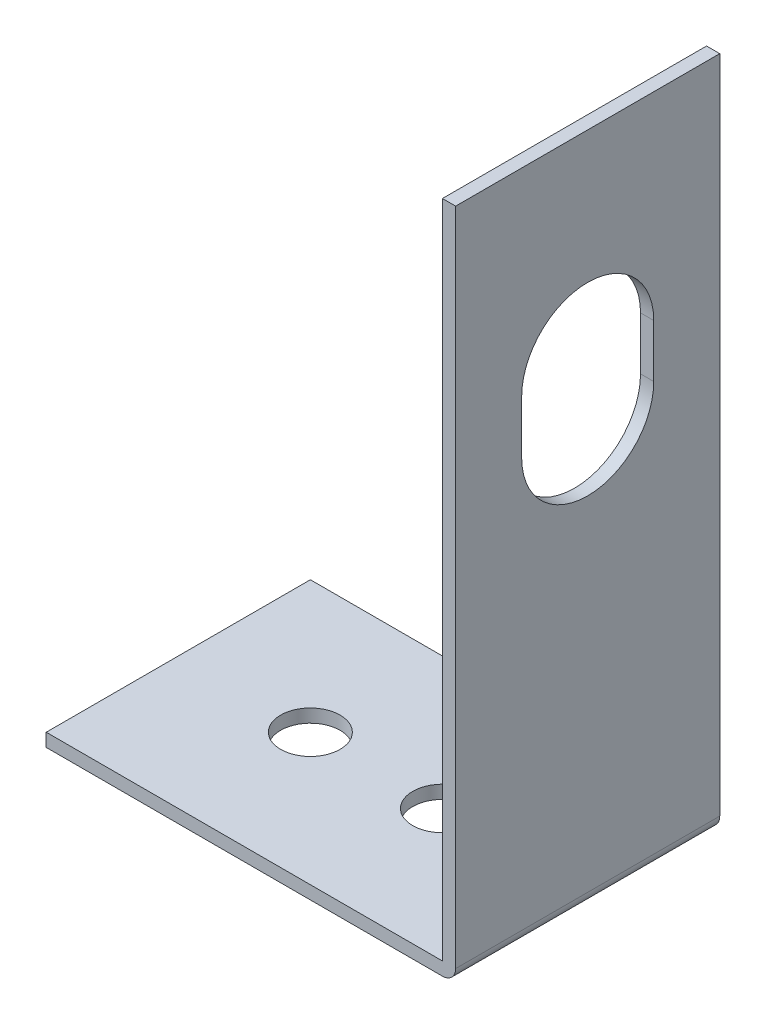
from build123d import *

# Parameters (mm, degrees)
EXTRUSION1_DEPTH        = 20
ENL_V_MAT_EXTRU_1_DEPTH = 62.64414003
ESQUISSE3_R             = 2.25
ENL_V_MAT_EXTRU_2_DEPTH = 62.64414003


with BuildPart() as part:
    # Esquisse1 → Extrusion1 (new body)
    with BuildSketch(Plane.XY):
        with BuildLine():
            Line((0, 0), (0, 50))
            Line((0, 50), (1, 50))
            Line((1, 50), (1, 0))
            ThreePointArc((1, 0), (0.707106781, -0.707106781), (0, -1))
            Line((0, -1), (-30, -1))
            Line((-30, -1), (-30, 0))
            Line((-30, 0), (0, 0))
        make_face()
    extrude(amount=EXTRUSION1_DEPTH)

    # Esquisse2 → Enl_v. mat.-Extru.1 (cut, through all)
    with BuildSketch(Plane.ZY):
        with BuildLine():
            Line((5, 35), (5, 31))
            ThreePointArc((5, 31), (10, 26), (15, 31))
            Line((15, 31), (15, 35))
            ThreePointArc((15, 35), (10, 40), (5, 35))
        make_face()
    extrude(amount=-ENL_V_MAT_EXTRU_1_DEPTH, mode=Mode.SUBTRACT)

    # Esquisse3 → Enl_v. mat.-Extru.2 (cut, through all)
    with BuildSketch(Plane(origin=(0, 0, 0), x_dir=(-1, 0, 0), z_dir=(0, 1, 0))):
        with Locations((10, 10)):
            Circle(ESQUISSE3_R)
        with Locations((20, 10)):
            Circle(ESQUISSE3_R)
    extrude(amount=-ENL_V_MAT_EXTRU_2_DEPTH, mode=Mode.SUBTRACT)


solid = part.part
